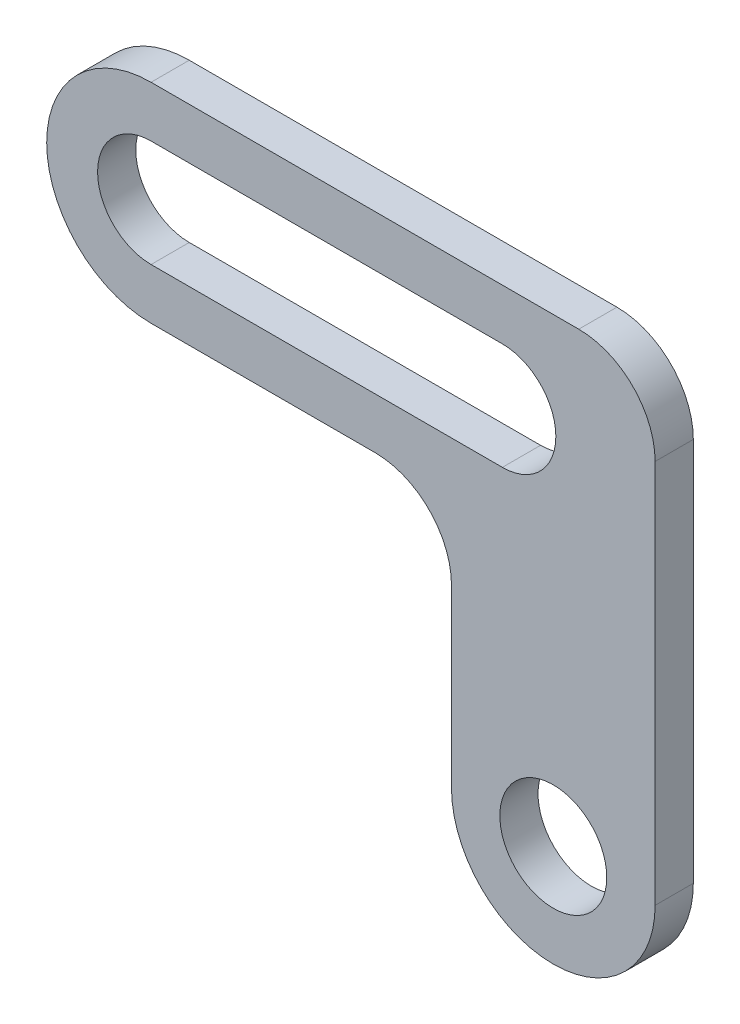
from build123d import *

# Parameters (mm, degrees)
ESQUISSE1_R        = 21
BOSS_EXTRU_1_DEPTH = 15
CONG_1_R           = 30


with BuildPart() as part:
    # Esquisse1 → Boss.-Extru.1 (new body)
    with BuildSketch(Plane.XY):
        with BuildLine():
            Line((40, 0), (40, 181))
            Line((40, 181), (-158, 181))
            ThreePointArc((-158, 181), (-199, 140), (-158, 99))
            Line((-158, 99), (-40, 99))
            Line((-40, 99), (-40, 0))
            ThreePointArc((-40, 0), (0, -40), (40, 0))
        make_face()
        Circle(ESQUISSE1_R, mode=Mode.SUBTRACT)
        with BuildLine():
            Line((-158, 161), (-20, 161))
            ThreePointArc((-20, 161), (1, 140), (-20, 119))
            Line((-20, 119), (-158, 119))
            ThreePointArc((-158, 119), (-179, 140), (-158, 161))
        make_face(mode=Mode.SUBTRACT)
    extrude(amount=BOSS_EXTRU_1_DEPTH)

    # Cong_1
    cong_1_edges = [part.edges().sort_by_distance(p)[0] for p in [
        (-40, 99, 7.5),
        (40, 181, 7.5),
    ]]
    fillet(cong_1_edges, radius=CONG_1_R)


solid = part.part
